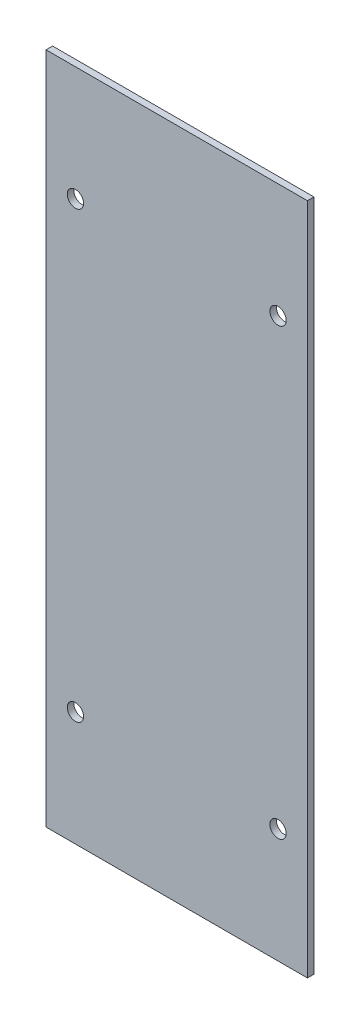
ISO-10303-21;
HEADER;
FILE_DESCRIPTION(('STEP AP214'),'2;1');
FILE_NAME('part.step','',(''),(''),'','','');
FILE_SCHEMA(('AUTOMOTIVE_DESIGN { 1 0 10303 214 1 1 1 1 }'));
ENDSEC;
DATA;
#1=APPLICATION_CONTEXT('core data for automotive mechanical design processes');
#2=APPLICATION_PROTOCOL_DEFINITION('international standard','automotive_design',2000,#1);
#3=PRODUCT_CONTEXT('',#1,'mechanical');
#4=PRODUCT('Part','Part','',(#3));
#5=PRODUCT_RELATED_PRODUCT_CATEGORY('part','',(#4));
#6=PRODUCT_DEFINITION_FORMATION('','',#4);
#7=PRODUCT_DEFINITION_CONTEXT('part definition',#1,'design');
#8=PRODUCT_DEFINITION('design','',#6,#7);
#9=PRODUCT_DEFINITION_SHAPE('','',#8);
#10=(LENGTH_UNIT() NAMED_UNIT(*) SI_UNIT(.MILLI.,.METRE.));
#11=(NAMED_UNIT(*) PLANE_ANGLE_UNIT() SI_UNIT($,.RADIAN.));
#12=(NAMED_UNIT(*) SI_UNIT($,.STERADIAN.) SOLID_ANGLE_UNIT());
#13=UNCERTAINTY_MEASURE_WITH_UNIT(LENGTH_MEASURE(1.E-05),#10,'distance_accuracy_value','');
#14=(GEOMETRIC_REPRESENTATION_CONTEXT(3) GLOBAL_UNCERTAINTY_ASSIGNED_CONTEXT((#13)) GLOBAL_UNIT_ASSIGNED_CONTEXT((#10,
#11,#12)) REPRESENTATION_CONTEXT('',''));
#15=CARTESIAN_POINT('',(0.,0.,0.));
#16=DIRECTION('',(0.,0.,1.));
#17=DIRECTION('',(1.,0.,0.));
#18=AXIS2_PLACEMENT_3D('',#15,#16,#17);
#19=CARTESIAN_POINT('',(0.,0.,2.));
#20=DIRECTION('',(0.,0.,1.));
#21=DIRECTION('',(1.,0.,0.));
#22=AXIS2_PLACEMENT_3D('',#19,#20,#21);
#23=PLANE('',#22);
#24=CARTESIAN_POINT('',(-31.,-68.,2.));
#25=DIRECTION('',(0.,0.,1.));
#26=DIRECTION('',(1.,0.,0.));
#27=AXIS2_PLACEMENT_3D('',#24,#25,#26);
#28=CIRCLE('',#27,2.5);
#29=CARTESIAN_POINT('',(-28.5,-68.,2.));
#30=VERTEX_POINT('',#29);
#31=EDGE_CURVE('E129',#30,#30,#28,.T.);
#32=ORIENTED_EDGE('',*,*,#31,.F.);
#33=EDGE_LOOP('',(#32));
#34=FACE_BOUND('',#33,.T.);
#35=CARTESIAN_POINT('',(-31.,68.,2.));
#36=DIRECTION('',(0.,0.,1.));
#37=DIRECTION('',(1.,0.,0.));
#38=AXIS2_PLACEMENT_3D('',#35,#36,#37);
#39=CIRCLE('',#38,2.5);
#40=CARTESIAN_POINT('',(-28.5,68.,2.));
#41=VERTEX_POINT('',#40);
#42=EDGE_CURVE('E107',#41,#41,#39,.T.);
#43=ORIENTED_EDGE('',*,*,#42,.F.);
#44=EDGE_LOOP('',(#43));
#45=FACE_BOUND('',#44,.T.);
#46=DIRECTION('',(0.,-1.,0.));
#47=VECTOR('',#46,1.);
#48=CARTESIAN_POINT('',(-40.,-103.,2.));
#49=LINE('',#48,#47);
#50=CARTESIAN_POINT('',(-40.,103.,2.));
#51=VERTEX_POINT('',#50);
#52=CARTESIAN_POINT('',(-40.,-103.,2.));
#53=VERTEX_POINT('',#52);
#54=EDGE_CURVE('E91',#51,#53,#49,.T.);
#55=ORIENTED_EDGE('',*,*,#54,.T.);
#56=DIRECTION('',(1.,0.,0.));
#57=VECTOR('',#56,1.);
#58=CARTESIAN_POINT('',(40.,-103.,2.));
#59=LINE('',#58,#57);
#60=CARTESIAN_POINT('',(40.,-103.,2.));
#61=VERTEX_POINT('',#60);
#62=EDGE_CURVE('E86',#53,#61,#59,.T.);
#63=ORIENTED_EDGE('',*,*,#62,.T.);
#64=DIRECTION('',(0.,1.,0.));
#65=VECTOR('',#64,1.);
#66=CARTESIAN_POINT('',(40.,-103.,2.));
#67=LINE('',#66,#65);
#68=CARTESIAN_POINT('',(40.,103.,2.));
#69=VERTEX_POINT('',#68);
#70=EDGE_CURVE('E93',#61,#69,#67,.T.);
#71=ORIENTED_EDGE('',*,*,#70,.T.);
#72=DIRECTION('',(-1.,0.,0.));
#73=VECTOR('',#72,1.);
#74=CARTESIAN_POINT('',(40.,103.,2.));
#75=LINE('',#74,#73);
#76=EDGE_CURVE('E59',#69,#51,#75,.T.);
#77=ORIENTED_EDGE('',*,*,#76,.T.);
#78=EDGE_LOOP('',(#55,#63,#71,#77));
#79=FACE_BOUND('',#78,.T.);
#80=CARTESIAN_POINT('',(31.,68.,2.));
#81=DIRECTION('',(0.,0.,1.));
#82=DIRECTION('',(1.,0.,0.));
#83=AXIS2_PLACEMENT_3D('',#80,#81,#82);
#84=CIRCLE('',#83,2.5);
#85=CARTESIAN_POINT('',(33.5,68.,2.));
#86=VERTEX_POINT('',#85);
#87=EDGE_CURVE('E125',#86,#86,#84,.T.);
#88=ORIENTED_EDGE('',*,*,#87,.F.);
#89=EDGE_LOOP('',(#88));
#90=FACE_BOUND('',#89,.T.);
#91=CARTESIAN_POINT('',(31.,-68.,2.));
#92=DIRECTION('',(0.,0.,1.));
#93=DIRECTION('',(1.,0.,0.));
#94=AXIS2_PLACEMENT_3D('',#91,#92,#93);
#95=CIRCLE('',#94,2.5);
#96=CARTESIAN_POINT('',(33.5,-68.,2.));
#97=VERTEX_POINT('',#96);
#98=EDGE_CURVE('E134',#97,#97,#95,.T.);
#99=ORIENTED_EDGE('',*,*,#98,.F.);
#100=EDGE_LOOP('',(#99));
#101=FACE_BOUND('',#100,.T.);
#102=ADVANCED_FACE('F41',(#34,#45,#79,#90,#101),#23,.T.);
#103=CARTESIAN_POINT('',(0.,0.,0.));
#104=DIRECTION('',(0.,0.,1.));
#105=DIRECTION('',(1.,0.,0.));
#106=AXIS2_PLACEMENT_3D('',#103,#104,#105);
#107=PLANE('',#106);
#108=DIRECTION('',(0.,-1.,0.));
#109=VECTOR('',#108,1.);
#110=CARTESIAN_POINT('',(-40.,-103.,0.));
#111=LINE('',#110,#109);
#112=CARTESIAN_POINT('',(-40.,103.,0.));
#113=VERTEX_POINT('',#112);
#114=CARTESIAN_POINT('',(-40.,-103.,0.));
#115=VERTEX_POINT('',#114);
#116=EDGE_CURVE('E104',#113,#115,#111,.T.);
#117=ORIENTED_EDGE('',*,*,#116,.F.);
#118=DIRECTION('',(-1.,0.,0.));
#119=VECTOR('',#118,1.);
#120=CARTESIAN_POINT('',(40.,103.,0.));
#121=LINE('',#120,#119);
#122=CARTESIAN_POINT('',(40.,103.,0.));
#123=VERTEX_POINT('',#122);
#124=EDGE_CURVE('E82',#123,#113,#121,.T.);
#125=ORIENTED_EDGE('',*,*,#124,.F.);
#126=DIRECTION('',(0.,1.,0.));
#127=VECTOR('',#126,1.);
#128=CARTESIAN_POINT('',(40.,-103.,0.));
#129=LINE('',#128,#127);
#130=CARTESIAN_POINT('',(40.,-103.,0.));
#131=VERTEX_POINT('',#130);
#132=EDGE_CURVE('E73',#131,#123,#129,.T.);
#133=ORIENTED_EDGE('',*,*,#132,.F.);
#134=DIRECTION('',(1.,0.,0.));
#135=VECTOR('',#134,1.);
#136=CARTESIAN_POINT('',(40.,-103.,0.));
#137=LINE('',#136,#135);
#138=EDGE_CURVE('E100',#115,#131,#137,.T.);
#139=ORIENTED_EDGE('',*,*,#138,.F.);
#140=EDGE_LOOP('',(#117,#125,#133,#139));
#141=FACE_BOUND('',#140,.T.);
#142=CARTESIAN_POINT('',(-31.,68.,0.));
#143=DIRECTION('',(0.,0.,1.));
#144=DIRECTION('',(1.,0.,0.));
#145=AXIS2_PLACEMENT_3D('',#142,#143,#144);
#146=CIRCLE('',#145,2.5);
#147=CARTESIAN_POINT('',(-28.5,68.,0.));
#148=VERTEX_POINT('',#147);
#149=EDGE_CURVE('E119',#148,#148,#146,.T.);
#150=ORIENTED_EDGE('',*,*,#149,.T.);
#151=EDGE_LOOP('',(#150));
#152=FACE_BOUND('',#151,.T.);
#153=CARTESIAN_POINT('',(31.,68.,0.));
#154=DIRECTION('',(0.,0.,1.));
#155=DIRECTION('',(1.,0.,0.));
#156=AXIS2_PLACEMENT_3D('',#153,#154,#155);
#157=CIRCLE('',#156,2.5);
#158=CARTESIAN_POINT('',(33.5,68.,0.));
#159=VERTEX_POINT('',#158);
#160=EDGE_CURVE('E127',#159,#159,#157,.T.);
#161=ORIENTED_EDGE('',*,*,#160,.T.);
#162=EDGE_LOOP('',(#161));
#163=FACE_BOUND('',#162,.T.);
#164=CARTESIAN_POINT('',(-31.,-68.,0.));
#165=DIRECTION('',(0.,0.,1.));
#166=DIRECTION('',(1.,0.,0.));
#167=AXIS2_PLACEMENT_3D('',#164,#165,#166);
#168=CIRCLE('',#167,2.5);
#169=CARTESIAN_POINT('',(-28.5,-68.,0.));
#170=VERTEX_POINT('',#169);
#171=EDGE_CURVE('E135',#170,#170,#168,.T.);
#172=ORIENTED_EDGE('',*,*,#171,.T.);
#173=EDGE_LOOP('',(#172));
#174=FACE_BOUND('',#173,.T.);
#175=CARTESIAN_POINT('',(31.,-68.,0.));
#176=DIRECTION('',(0.,0.,1.));
#177=DIRECTION('',(1.,0.,0.));
#178=AXIS2_PLACEMENT_3D('',#175,#176,#177);
#179=CIRCLE('',#178,2.5);
#180=CARTESIAN_POINT('',(33.5,-68.,0.));
#181=VERTEX_POINT('',#180);
#182=EDGE_CURVE('E140',#181,#181,#179,.T.);
#183=ORIENTED_EDGE('',*,*,#182,.T.);
#184=EDGE_LOOP('',(#183));
#185=FACE_BOUND('',#184,.T.);
#186=ADVANCED_FACE('F116',(#141,#152,#163,#174,#185),#107,.F.);
#187=CARTESIAN_POINT('',(-40.,-103.,2.));
#188=DIRECTION('',(1.,0.,0.));
#189=DIRECTION('',(0.,0.,-1.));
#190=AXIS2_PLACEMENT_3D('',#187,#188,#189);
#191=PLANE('',#190);
#192=ORIENTED_EDGE('',*,*,#116,.T.);
#193=DIRECTION('',(0.,0.,-1.));
#194=VECTOR('',#193,1.);
#195=CARTESIAN_POINT('',(-40.,-103.,2.));
#196=LINE('',#195,#194);
#197=EDGE_CURVE('E11',#53,#115,#196,.T.);
#198=ORIENTED_EDGE('',*,*,#197,.F.);
#199=ORIENTED_EDGE('',*,*,#54,.F.);
#200=DIRECTION('',(0.,0.,-1.));
#201=VECTOR('',#200,1.);
#202=CARTESIAN_POINT('',(-40.,103.,2.));
#203=LINE('',#202,#201);
#204=EDGE_CURVE('E101',#51,#113,#203,.T.);
#205=ORIENTED_EDGE('',*,*,#204,.T.);
#206=EDGE_LOOP('',(#192,#198,#199,#205));
#207=FACE_BOUND('',#206,.T.);
#208=ADVANCED_FACE('F43',(#207),#191,.F.);
#209=CARTESIAN_POINT('',(40.,-103.,2.));
#210=DIRECTION('',(0.,1.,0.));
#211=DIRECTION('',(0.,0.,1.));
#212=AXIS2_PLACEMENT_3D('',#209,#210,#211);
#213=PLANE('',#212);
#214=ORIENTED_EDGE('',*,*,#138,.T.);
#215=DIRECTION('',(0.,0.,-1.));
#216=VECTOR('',#215,1.);
#217=CARTESIAN_POINT('',(40.,-103.,2.));
#218=LINE('',#217,#216);
#219=EDGE_CURVE('E49',#61,#131,#218,.T.);
#220=ORIENTED_EDGE('',*,*,#219,.F.);
#221=ORIENTED_EDGE('',*,*,#62,.F.);
#222=ORIENTED_EDGE('',*,*,#197,.T.);
#223=EDGE_LOOP('',(#214,#220,#221,#222));
#224=FACE_BOUND('',#223,.T.);
#225=ADVANCED_FACE('F96',(#224),#213,.F.);
#226=CARTESIAN_POINT('',(40.,-103.,2.));
#227=DIRECTION('',(-1.,0.,0.));
#228=DIRECTION('',(0.,0.,1.));
#229=AXIS2_PLACEMENT_3D('',#226,#227,#228);
#230=PLANE('',#229);
#231=ORIENTED_EDGE('',*,*,#132,.T.);
#232=DIRECTION('',(0.,0.,-1.));
#233=VECTOR('',#232,1.);
#234=CARTESIAN_POINT('',(40.,103.,2.));
#235=LINE('',#234,#233);
#236=EDGE_CURVE('E98',#69,#123,#235,.T.);
#237=ORIENTED_EDGE('',*,*,#236,.F.);
#238=ORIENTED_EDGE('',*,*,#70,.F.);
#239=ORIENTED_EDGE('',*,*,#219,.T.);
#240=EDGE_LOOP('',(#231,#237,#238,#239));
#241=FACE_BOUND('',#240,.T.);
#242=ADVANCED_FACE('F97',(#241),#230,.F.);
#243=CARTESIAN_POINT('',(40.,103.,2.));
#244=DIRECTION('',(0.,-1.,0.));
#245=DIRECTION('',(0.,0.,-1.));
#246=AXIS2_PLACEMENT_3D('',#243,#244,#245);
#247=PLANE('',#246);
#248=ORIENTED_EDGE('',*,*,#124,.T.);
#249=ORIENTED_EDGE('',*,*,#204,.F.);
#250=ORIENTED_EDGE('',*,*,#76,.F.);
#251=ORIENTED_EDGE('',*,*,#236,.T.);
#252=EDGE_LOOP('',(#248,#249,#250,#251));
#253=FACE_BOUND('',#252,.T.);
#254=ADVANCED_FACE('F114',(#253),#247,.F.);
#255=CARTESIAN_POINT('',(-31.,68.,2.));
#256=DIRECTION('',(0.,0.,-1.));
#257=DIRECTION('',(-1.,0.,0.));
#258=AXIS2_PLACEMENT_3D('',#255,#256,#257);
#259=CYLINDRICAL_SURFACE('',#258,2.5);
#260=ORIENTED_EDGE('',*,*,#42,.T.);
#261=EDGE_LOOP('',(#260));
#262=FACE_BOUND('',#261,.T.);
#263=ORIENTED_EDGE('',*,*,#149,.F.);
#264=EDGE_LOOP('',(#263));
#265=FACE_BOUND('',#264,.T.);
#266=ADVANCED_FACE('F160',(#262,#265),#259,.F.);
#267=CARTESIAN_POINT('',(31.,68.,2.));
#268=DIRECTION('',(0.,0.,-1.));
#269=DIRECTION('',(-1.,0.,0.));
#270=AXIS2_PLACEMENT_3D('',#267,#268,#269);
#271=CYLINDRICAL_SURFACE('',#270,2.5);
#272=ORIENTED_EDGE('',*,*,#87,.T.);
#273=EDGE_LOOP('',(#272));
#274=FACE_BOUND('',#273,.T.);
#275=ORIENTED_EDGE('',*,*,#160,.F.);
#276=EDGE_LOOP('',(#275));
#277=FACE_BOUND('',#276,.T.);
#278=ADVANCED_FACE('F205',(#274,#277),#271,.F.);
#279=CARTESIAN_POINT('',(-31.,-68.,2.));
#280=DIRECTION('',(0.,0.,-1.));
#281=DIRECTION('',(-1.,0.,0.));
#282=AXIS2_PLACEMENT_3D('',#279,#280,#281);
#283=CYLINDRICAL_SURFACE('',#282,2.5);
#284=ORIENTED_EDGE('',*,*,#31,.T.);
#285=EDGE_LOOP('',(#284));
#286=FACE_BOUND('',#285,.T.);
#287=ORIENTED_EDGE('',*,*,#171,.F.);
#288=EDGE_LOOP('',(#287));
#289=FACE_BOUND('',#288,.T.);
#290=ADVANCED_FACE('F209',(#286,#289),#283,.F.);
#291=CARTESIAN_POINT('',(31.,-68.,2.));
#292=DIRECTION('',(0.,0.,-1.));
#293=DIRECTION('',(-1.,0.,0.));
#294=AXIS2_PLACEMENT_3D('',#291,#292,#293);
#295=CYLINDRICAL_SURFACE('',#294,2.5);
#296=ORIENTED_EDGE('',*,*,#98,.T.);
#297=EDGE_LOOP('',(#296));
#298=FACE_BOUND('',#297,.T.);
#299=ORIENTED_EDGE('',*,*,#182,.F.);
#300=EDGE_LOOP('',(#299));
#301=FACE_BOUND('',#300,.T.);
#302=ADVANCED_FACE('F145',(#298,#301),#295,.F.);
#303=CLOSED_SHELL('',(#102,#186,#208,#225,#242,#254,#266,#278,#290,#302));
#304=MANIFOLD_SOLID_BREP('B2',#303);
#305=ADVANCED_BREP_SHAPE_REPRESENTATION('',(#18,#304),#14);
#306=SHAPE_DEFINITION_REPRESENTATION(#9,#305);
ENDSEC;
END-ISO-10303-21;
